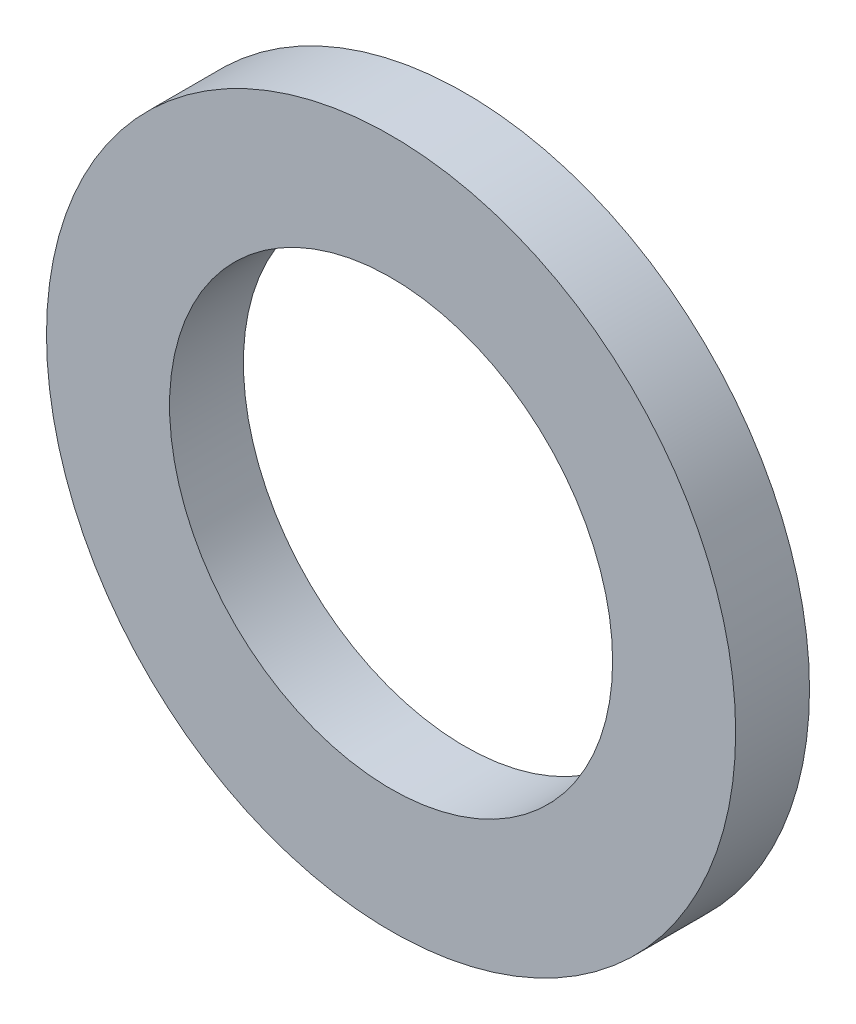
ISO-10303-21;
HEADER;
FILE_DESCRIPTION(('STEP AP214'),'2;1');
FILE_NAME('part.step','',(''),(''),'','','');
FILE_SCHEMA(('AUTOMOTIVE_DESIGN { 1 0 10303 214 1 1 1 1 }'));
ENDSEC;
DATA;
#1=APPLICATION_CONTEXT('core data for automotive mechanical design processes');
#2=APPLICATION_PROTOCOL_DEFINITION('international standard','automotive_design',2000,#1);
#3=PRODUCT_CONTEXT('',#1,'mechanical');
#4=PRODUCT('Part','Part','',(#3));
#5=PRODUCT_RELATED_PRODUCT_CATEGORY('part','',(#4));
#6=PRODUCT_DEFINITION_FORMATION('','',#4);
#7=PRODUCT_DEFINITION_CONTEXT('part definition',#1,'design');
#8=PRODUCT_DEFINITION('design','',#6,#7);
#9=PRODUCT_DEFINITION_SHAPE('','',#8);
#10=(LENGTH_UNIT() NAMED_UNIT(*) SI_UNIT(.MILLI.,.METRE.));
#11=(NAMED_UNIT(*) PLANE_ANGLE_UNIT() SI_UNIT($,.RADIAN.));
#12=(NAMED_UNIT(*) SI_UNIT($,.STERADIAN.) SOLID_ANGLE_UNIT());
#13=UNCERTAINTY_MEASURE_WITH_UNIT(LENGTH_MEASURE(1.E-05),#10,'distance_accuracy_value','');
#14=(GEOMETRIC_REPRESENTATION_CONTEXT(3) GLOBAL_UNCERTAINTY_ASSIGNED_CONTEXT((#13)) GLOBAL_UNIT_ASSIGNED_CONTEXT((#10,
#11,#12)) REPRESENTATION_CONTEXT('',''));
#15=CARTESIAN_POINT('',(0.,0.,0.));
#16=DIRECTION('',(0.,0.,1.));
#17=DIRECTION('',(1.,0.,0.));
#18=AXIS2_PLACEMENT_3D('',#15,#16,#17);
#19=CARTESIAN_POINT('',(0.,0.,0.));
#20=DIRECTION('',(0.,0.,1.));
#21=DIRECTION('',(1.,0.,0.));
#22=AXIS2_PLACEMENT_3D('',#19,#20,#21);
#23=CYLINDRICAL_SURFACE('',#22,4.5);
#24=CARTESIAN_POINT('',(0.,0.,1.5));
#25=DIRECTION('',(0.,0.,1.));
#26=DIRECTION('',(1.,0.,0.));
#27=AXIS2_PLACEMENT_3D('',#24,#25,#26);
#28=CIRCLE('',#27,4.5);
#29=CARTESIAN_POINT('',(4.5,0.,1.5));
#30=VERTEX_POINT('',#29);
#31=EDGE_CURVE('E10',#30,#30,#28,.T.);
#32=ORIENTED_EDGE('',*,*,#31,.T.);
#33=EDGE_LOOP('',(#32));
#34=FACE_BOUND('',#33,.T.);
#35=CARTESIAN_POINT('',(0.,0.,0.));
#36=DIRECTION('',(0.,0.,1.));
#37=DIRECTION('',(1.,0.,0.));
#38=AXIS2_PLACEMENT_3D('',#35,#36,#37);
#39=CIRCLE('',#38,4.5);
#40=CARTESIAN_POINT('',(4.5,0.,0.));
#41=VERTEX_POINT('',#40);
#42=EDGE_CURVE('E45',#41,#41,#39,.T.);
#43=ORIENTED_EDGE('',*,*,#42,.F.);
#44=EDGE_LOOP('',(#43));
#45=FACE_BOUND('',#44,.T.);
#46=ADVANCED_FACE('F31',(#34,#45),#23,.F.);
#47=CARTESIAN_POINT('',(4.5,0.,1.5));
#48=DIRECTION('',(0.,0.,1.));
#49=DIRECTION('',(1.,0.,0.));
#50=AXIS2_PLACEMENT_3D('',#47,#48,#49);
#51=PLANE('',#50);
#52=CARTESIAN_POINT('',(0.,0.,1.5));
#53=DIRECTION('',(0.,0.,1.));
#54=DIRECTION('',(1.,0.,0.));
#55=AXIS2_PLACEMENT_3D('',#52,#53,#54);
#56=CIRCLE('',#55,7.);
#57=CARTESIAN_POINT('',(7.,0.,1.5));
#58=VERTEX_POINT('',#57);
#59=EDGE_CURVE('E37',#58,#58,#56,.T.);
#60=ORIENTED_EDGE('',*,*,#59,.T.);
#61=EDGE_LOOP('',(#60));
#62=FACE_BOUND('',#61,.T.);
#63=ORIENTED_EDGE('',*,*,#31,.F.);
#64=EDGE_LOOP('',(#63));
#65=FACE_BOUND('',#64,.T.);
#66=ADVANCED_FACE('F55',(#62,#65),#51,.T.);
#67=CARTESIAN_POINT('',(0.,0.,0.));
#68=DIRECTION('',(0.,0.,1.));
#69=DIRECTION('',(1.,0.,0.));
#70=AXIS2_PLACEMENT_3D('',#67,#68,#69);
#71=CYLINDRICAL_SURFACE('',#70,7.);
#72=CARTESIAN_POINT('',(0.,0.,0.));
#73=DIRECTION('',(0.,0.,1.));
#74=DIRECTION('',(1.,0.,0.));
#75=AXIS2_PLACEMENT_3D('',#72,#73,#74);
#76=CIRCLE('',#75,7.);
#77=CARTESIAN_POINT('',(7.,0.,0.));
#78=VERTEX_POINT('',#77);
#79=EDGE_CURVE('E41',#78,#78,#76,.T.);
#80=ORIENTED_EDGE('',*,*,#79,.T.);
#81=EDGE_LOOP('',(#80));
#82=FACE_BOUND('',#81,.T.);
#83=ORIENTED_EDGE('',*,*,#59,.F.);
#84=EDGE_LOOP('',(#83));
#85=FACE_BOUND('',#84,.T.);
#86=ADVANCED_FACE('F59',(#82,#85),#71,.T.);
#87=CARTESIAN_POINT('',(7.,0.,0.));
#88=DIRECTION('',(0.,0.,-1.));
#89=DIRECTION('',(-1.,0.,0.));
#90=AXIS2_PLACEMENT_3D('',#87,#88,#89);
#91=PLANE('',#90);
#92=ORIENTED_EDGE('',*,*,#42,.T.);
#93=EDGE_LOOP('',(#92));
#94=FACE_BOUND('',#93,.T.);
#95=ORIENTED_EDGE('',*,*,#79,.F.);
#96=EDGE_LOOP('',(#95));
#97=FACE_BOUND('',#96,.T.);
#98=ADVANCED_FACE('F51',(#94,#97),#91,.T.);
#99=CLOSED_SHELL('',(#46,#66,#86,#98));
#100=MANIFOLD_SOLID_BREP('B2',#99);
#101=ADVANCED_BREP_SHAPE_REPRESENTATION('',(#18,#100),#14);
#102=SHAPE_DEFINITION_REPRESENTATION(#9,#101);
ENDSEC;
END-ISO-10303-21;
